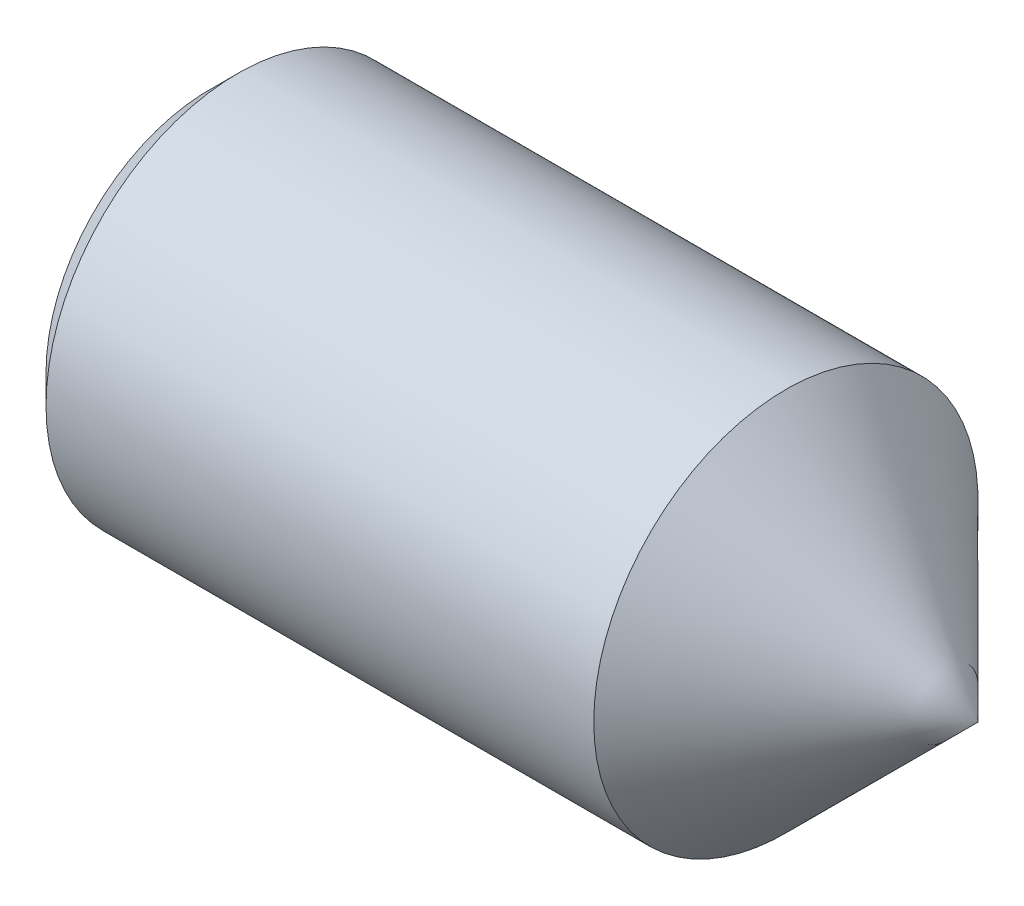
from build123d import *

# Parameters (mm, degrees)
HEX_2_DEPTH = 14.2748


with BuildPart() as part:
    # BodySke → BaseBody (revolve)
    with BuildSketch(Plane.XY, mode=Mode.PRIVATE) as basebody_sk:
        Polygon((0, 0), (0, 10.81024), (1.88976, 12.7), (38.1, 12.7), (50.8, 0), align=None)
    revolve(basebody_sk.sketch.rotate(Axis((-12.7, 0, 0), (1, 0, 0)), 90), axis=Axis((-12.7, 0, 0), (1, 0, 0)))

    # Sketch2 → Hex 2 (cut)
    with BuildSketch(Plane.ZY):
        Polygon((4.120779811, 7.1374), (-4.120779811, 7.1374), (-8.241559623, 0), (-4.120779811, -7.1374), (4.120779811, -7.1374), (8.241559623, 0), align=None)
    extrude(amount=-HEX_2_DEPTH, mode=Mode.SUBTRACT)


solid = part.part
